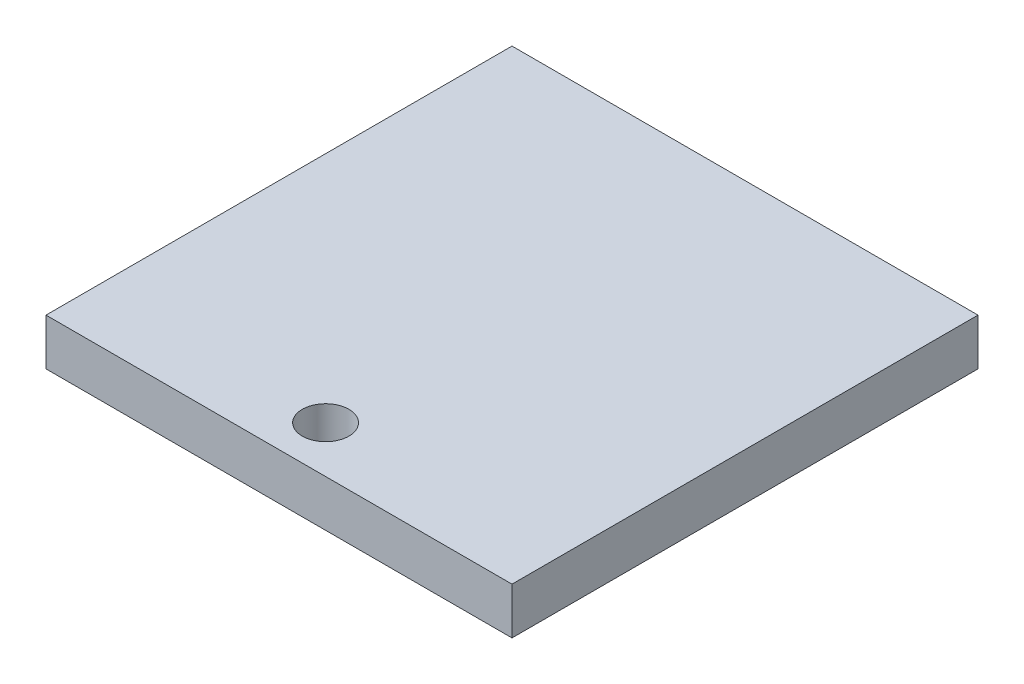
from build123d import *

# Parameters (mm, degrees)
SKETCH1_W          = 50
SKETCH1_H          = 50
EXTRUDE1_DEPTH     = 5
SKETCH2_R          = 2.5
CUT_EXTRUDE2_DEPTH = 71.887234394


with BuildPart() as part:
    # Sketch1 → Extrude1 (new body)
    with BuildSketch(Plane(origin=(0, 0, 0), x_dir=(1, 0, 0), z_dir=(0, 1, 0))):
        with Locations((25, 25)):
            Rectangle(SKETCH1_W, SKETCH1_H)
    extrude(amount=EXTRUDE1_DEPTH)

    # Sketch2 → Cut-Extrude2 (cut, through all)
    with BuildSketch(Plane(origin=(0, 5, 0), x_dir=(-1, 0, 0), z_dir=(0, 1, 0))):
        with Locations(Location((-25, -5, 0), (0, 0, 90))):
            Circle(SKETCH2_R)
    extrude(amount=-CUT_EXTRUDE2_DEPTH, mode=Mode.SUBTRACT)


solid = part.part
